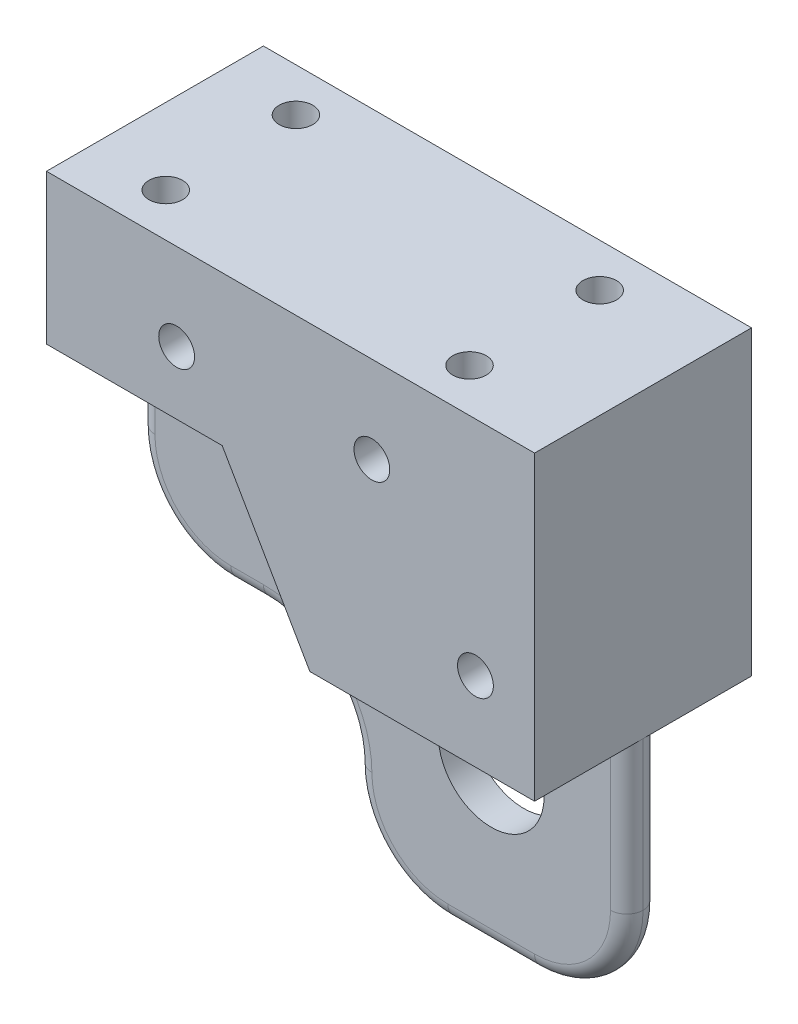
ISO-10303-21;
HEADER;
FILE_DESCRIPTION(('STEP AP214'),'2;1');
FILE_NAME('part.step','',(''),(''),'','','');
FILE_SCHEMA(('AUTOMOTIVE_DESIGN { 1 0 10303 214 1 1 1 1 }'));
ENDSEC;
DATA;
#1=APPLICATION_CONTEXT('core data for automotive mechanical design processes');
#2=APPLICATION_PROTOCOL_DEFINITION('international standard','automotive_design',2000,#1);
#3=PRODUCT_CONTEXT('',#1,'mechanical');
#4=PRODUCT('Part','Part','',(#3));
#5=PRODUCT_RELATED_PRODUCT_CATEGORY('part','',(#4));
#6=PRODUCT_DEFINITION_FORMATION('','',#4);
#7=PRODUCT_DEFINITION_CONTEXT('part definition',#1,'design');
#8=PRODUCT_DEFINITION('design','',#6,#7);
#9=PRODUCT_DEFINITION_SHAPE('','',#8);
#10=(LENGTH_UNIT() NAMED_UNIT(*) SI_UNIT(.MILLI.,.METRE.));
#11=(NAMED_UNIT(*) PLANE_ANGLE_UNIT() SI_UNIT($,.RADIAN.));
#12=(NAMED_UNIT(*) SI_UNIT($,.STERADIAN.) SOLID_ANGLE_UNIT());
#13=UNCERTAINTY_MEASURE_WITH_UNIT(LENGTH_MEASURE(1.E-05),#10,'distance_accuracy_value','');
#14=(GEOMETRIC_REPRESENTATION_CONTEXT(3) GLOBAL_UNCERTAINTY_ASSIGNED_CONTEXT((#13)) GLOBAL_UNIT_ASSIGNED_CONTEXT((#10,
#11,#12)) REPRESENTATION_CONTEXT('',''));
#15=CARTESIAN_POINT('',(0.,0.,0.));
#16=DIRECTION('',(0.,0.,1.));
#17=DIRECTION('',(1.,0.,0.));
#18=AXIS2_PLACEMENT_3D('',#15,#16,#17);
#19=CARTESIAN_POINT('',(35.,-17.5,-4.5));
#20=DIRECTION('',(0.,1.,0.));
#21=DIRECTION('',(0.,0.,1.));
#22=AXIS2_PLACEMENT_3D('',#19,#20,#21);
#23=CYLINDRICAL_SURFACE('',#22,1.55);
#24=CARTESIAN_POINT('',(35.,32.5,-4.5));
#25=DIRECTION('',(0.,1.,0.));
#26=DIRECTION('',(0.,0.,1.));
#27=AXIS2_PLACEMENT_3D('',#24,#25,#26);
#28=CIRCLE('',#27,1.55);
#29=CARTESIAN_POINT('',(35.,32.5,-2.95));
#30=VERTEX_POINT('',#29);
#31=EDGE_CURVE('E295',#30,#30,#28,.T.);
#32=ORIENTED_EDGE('',*,*,#31,.T.);
#33=EDGE_LOOP('',(#32));
#34=FACE_BOUND('',#33,.T.);
#35=CARTESIAN_POINT('',(35.,26.1,-4.5));
#36=DIRECTION('',(0.,-1.,0.));
#37=DIRECTION('',(1.,0.,0.));
#38=AXIS2_PLACEMENT_3D('',#35,#36,#37);
#39=CIRCLE('',#38,1.55);
#40=CARTESIAN_POINT('',(36.55,26.1,-4.5));
#41=VERTEX_POINT('',#40);
#42=EDGE_CURVE('E39',#41,#41,#39,.F.);
#43=ORIENTED_EDGE('',*,*,#42,.F.);
#44=EDGE_LOOP('',(#43));
#45=FACE_BOUND('',#44,.T.);
#46=ADVANCED_FACE('F35',(#34,#45),#23,.F.);
#47=CARTESIAN_POINT('',(35.,-17.5,7.5));
#48=DIRECTION('',(0.,1.,0.));
#49=DIRECTION('',(0.,0.,1.));
#50=AXIS2_PLACEMENT_3D('',#47,#48,#49);
#51=CYLINDRICAL_SURFACE('',#50,1.55);
#52=CARTESIAN_POINT('',(35.,32.5,7.5));
#53=DIRECTION('',(0.,1.,0.));
#54=DIRECTION('',(0.,0.,1.));
#55=AXIS2_PLACEMENT_3D('',#52,#53,#54);
#56=CIRCLE('',#55,1.55);
#57=CARTESIAN_POINT('',(35.,32.5,9.05));
#58=VERTEX_POINT('',#57);
#59=EDGE_CURVE('E336',#58,#58,#56,.T.);
#60=ORIENTED_EDGE('',*,*,#59,.T.);
#61=EDGE_LOOP('',(#60));
#62=FACE_BOUND('',#61,.T.);
#63=CARTESIAN_POINT('',(35.,26.1,7.5));
#64=DIRECTION('',(0.,-1.,0.));
#65=DIRECTION('',(1.,0.,0.));
#66=AXIS2_PLACEMENT_3D('',#63,#64,#65);
#67=CIRCLE('',#66,1.55);
#68=CARTESIAN_POINT('',(36.55,26.1,7.5));
#69=VERTEX_POINT('',#68);
#70=EDGE_CURVE('E301',#69,#69,#67,.F.);
#71=ORIENTED_EDGE('',*,*,#70,.F.);
#72=EDGE_LOOP('',(#71));
#73=FACE_BOUND('',#72,.T.);
#74=ADVANCED_FACE('F588',(#62,#73),#51,.F.);
#75=CARTESIAN_POINT('',(7.,-17.5,7.5));
#76=DIRECTION('',(0.,1.,0.));
#77=DIRECTION('',(0.,0.,1.));
#78=AXIS2_PLACEMENT_3D('',#75,#76,#77);
#79=CYLINDRICAL_SURFACE('',#78,1.55);
#80=CARTESIAN_POINT('',(7.,32.5,7.5));
#81=DIRECTION('',(0.,1.,0.));
#82=DIRECTION('',(0.,0.,-1.));
#83=AXIS2_PLACEMENT_3D('',#80,#81,#82);
#84=CIRCLE('',#83,1.55);
#85=CARTESIAN_POINT('',(7.,32.5,5.95));
#86=VERTEX_POINT('',#85);
#87=EDGE_CURVE('E332',#86,#86,#84,.T.);
#88=ORIENTED_EDGE('',*,*,#87,.T.);
#89=EDGE_LOOP('',(#88));
#90=FACE_BOUND('',#89,.T.);
#91=CARTESIAN_POINT('',(7.,26.1,7.5));
#92=DIRECTION('',(0.,-1.,0.));
#93=DIRECTION('',(0.,0.,-1.));
#94=AXIS2_PLACEMENT_3D('',#91,#92,#93);
#95=CIRCLE('',#94,1.55);
#96=CARTESIAN_POINT('',(7.,26.1,5.95));
#97=VERTEX_POINT('',#96);
#98=EDGE_CURVE('E248',#97,#97,#95,.F.);
#99=ORIENTED_EDGE('',*,*,#98,.F.);
#100=EDGE_LOOP('',(#99));
#101=FACE_BOUND('',#100,.T.);
#102=ADVANCED_FACE('F594',(#90,#101),#79,.F.);
#103=CARTESIAN_POINT('',(7.,-17.5,-4.5));
#104=DIRECTION('',(0.,1.,0.));
#105=DIRECTION('',(0.,0.,1.));
#106=AXIS2_PLACEMENT_3D('',#103,#104,#105);
#107=CYLINDRICAL_SURFACE('',#106,1.55);
#108=CARTESIAN_POINT('',(7.,32.5,-4.5));
#109=DIRECTION('',(0.,1.,0.));
#110=DIRECTION('',(0.,0.,1.));
#111=AXIS2_PLACEMENT_3D('',#108,#109,#110);
#112=CIRCLE('',#111,1.55);
#113=CARTESIAN_POINT('',(7.,32.5,-2.95));
#114=VERTEX_POINT('',#113);
#115=EDGE_CURVE('E335',#114,#114,#112,.T.);
#116=ORIENTED_EDGE('',*,*,#115,.T.);
#117=EDGE_LOOP('',(#116));
#118=FACE_BOUND('',#117,.T.);
#119=CARTESIAN_POINT('',(7.,26.1,-4.5));
#120=DIRECTION('',(0.,-1.,0.));
#121=DIRECTION('',(0.,0.,-1.));
#122=AXIS2_PLACEMENT_3D('',#119,#120,#121);
#123=CIRCLE('',#122,1.55);
#124=CARTESIAN_POINT('',(7.,26.1,-6.05));
#125=VERTEX_POINT('',#124);
#126=EDGE_CURVE('E296',#125,#125,#123,.F.);
#127=ORIENTED_EDGE('',*,*,#126,.F.);
#128=EDGE_LOOP('',(#127));
#129=FACE_BOUND('',#128,.T.);
#130=ADVANCED_FACE('F600',(#118,#129),#107,.F.);
#131=CARTESIAN_POINT('',(0.,0.,3.));
#132=DIRECTION('',(0.,0.,-1.));
#133=DIRECTION('',(-1.,0.,0.));
#134=AXIS2_PLACEMENT_3D('',#131,#132,#133);
#135=PLANE('',#134);
#136=CARTESIAN_POINT('',(36.5,-9.00000000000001,3.));
#137=DIRECTION('',(0.,0.,-1.));
#138=DIRECTION('',(-1.,0.,0.));
#139=AXIS2_PLACEMENT_3D('',#136,#137,#138);
#140=CIRCLE('',#139,7.);
#141=CARTESIAN_POINT('',(36.5,-16.,3.));
#142=VERTEX_POINT('',#141);
#143=CARTESIAN_POINT('',(43.5,-9.00000000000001,3.));
#144=VERTEX_POINT('',#143);
#145=EDGE_CURVE('E211',#142,#144,#140,.F.);
#146=ORIENTED_EDGE('',*,*,#145,.T.);
#147=DIRECTION('',(0.,1.,0.));
#148=VECTOR('',#147,1.);
#149=CARTESIAN_POINT('',(43.5,0.,3.));
#150=LINE('',#149,#148);
#151=CARTESIAN_POINT('',(43.5,4.69999999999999,3.));
#152=VERTEX_POINT('',#151);
#153=EDGE_CURVE('E232',#144,#152,#150,.T.);
#154=ORIENTED_EDGE('',*,*,#153,.T.);
#155=DIRECTION('',(-1.,0.,0.));
#156=VECTOR('',#155,1.);
#157=CARTESIAN_POINT('',(0.,4.69999999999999,3.));
#158=LINE('',#157,#156);
#159=CARTESIAN_POINT('',(24.2829037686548,4.69999999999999,3.));
#160=VERTEX_POINT('',#159);
#161=EDGE_CURVE('E388',#152,#160,#158,.T.);
#162=ORIENTED_EDGE('',*,*,#161,.T.);
#163=DIRECTION('',(-0.500000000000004,0.866025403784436,0.));
#164=VECTOR('',#163,1.);
#165=CARTESIAN_POINT('',(20.2473375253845,11.6898057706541,3.));
#166=LINE('',#165,#164);
#167=CARTESIAN_POINT('',(16.2,18.7,3.));
#168=VERTEX_POINT('',#167);
#169=EDGE_CURVE('E384',#160,#168,#166,.T.);
#170=ORIENTED_EDGE('',*,*,#169,.T.);
#171=DIRECTION('',(-1.,0.,0.));
#172=VECTOR('',#171,1.);
#173=CARTESIAN_POINT('',(0.,18.7,3.));
#174=LINE('',#173,#172);
#175=CARTESIAN_POINT('',(1.5,18.7,3.));
#176=VERTEX_POINT('',#175);
#177=EDGE_CURVE('E413',#168,#176,#174,.T.);
#178=ORIENTED_EDGE('',*,*,#177,.T.);
#179=DIRECTION('',(0.,-1.,0.));
#180=VECTOR('',#179,1.);
#181=CARTESIAN_POINT('',(1.5,0.,3.));
#182=LINE('',#181,#180);
#183=CARTESIAN_POINT('',(1.5,7.99999999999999,3.));
#184=VERTEX_POINT('',#183);
#185=EDGE_CURVE('E468',#176,#184,#182,.T.);
#186=ORIENTED_EDGE('',*,*,#185,.T.);
#187=CARTESIAN_POINT('',(8.5,7.99999999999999,3.));
#188=DIRECTION('',(0.,0.,-1.));
#189=DIRECTION('',(-1.,0.,0.));
#190=AXIS2_PLACEMENT_3D('',#187,#188,#189);
#191=CIRCLE('',#190,7.);
#192=CARTESIAN_POINT('',(8.5,0.999999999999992,3.));
#193=VERTEX_POINT('',#192);
#194=EDGE_CURVE('E470',#184,#193,#191,.F.);
#195=ORIENTED_EDGE('',*,*,#194,.T.);
#196=DIRECTION('',(-1.,0.,0.));
#197=VECTOR('',#196,1.);
#198=CARTESIAN_POINT('',(0.,0.999999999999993,3.));
#199=LINE('',#198,#197);
#200=CARTESIAN_POINT('',(11.5,0.999999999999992,3.));
#201=VERTEX_POINT('',#200);
#202=EDGE_CURVE('E472',#193,#201,#199,.F.);
#203=ORIENTED_EDGE('',*,*,#202,.T.);
#204=CARTESIAN_POINT('',(11.5,-9.00000000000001,3.));
#205=DIRECTION('',(0.,0.,-1.));
#206=DIRECTION('',(-1.,0.,0.));
#207=AXIS2_PLACEMENT_3D('',#204,#205,#206);
#208=CIRCLE('',#207,10.);
#209=CARTESIAN_POINT('',(21.5,-9.00000000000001,3.));
#210=VERTEX_POINT('',#209);
#211=EDGE_CURVE('E474',#201,#210,#208,.T.);
#212=ORIENTED_EDGE('',*,*,#211,.T.);
#213=CARTESIAN_POINT('',(28.5,-9.00000000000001,3.));
#214=DIRECTION('',(0.,0.,-1.));
#215=DIRECTION('',(-1.,0.,0.));
#216=AXIS2_PLACEMENT_3D('',#213,#214,#215);
#217=CIRCLE('',#216,7.);
#218=CARTESIAN_POINT('',(28.5,-16.,3.));
#219=VERTEX_POINT('',#218);
#220=EDGE_CURVE('E214',#210,#219,#217,.F.);
#221=ORIENTED_EDGE('',*,*,#220,.T.);
#222=DIRECTION('',(1.,0.,0.));
#223=VECTOR('',#222,1.);
#224=CARTESIAN_POINT('',(0.,-16.,3.));
#225=LINE('',#224,#223);
#226=EDGE_CURVE('E206',#219,#142,#225,.T.);
#227=ORIENTED_EDGE('',*,*,#226,.T.);
#228=EDGE_LOOP('',(#146,#154,#162,#170,#178,#186,#195,#203,#212,#221,#227));
#229=FACE_BOUND('',#228,.T.);
#230=CARTESIAN_POINT('',(32.5,-3.00000000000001,3.));
#231=DIRECTION('',(0.,0.,1.));
#232=DIRECTION('',(1.,0.,0.));
#233=AXIS2_PLACEMENT_3D('',#230,#231,#232);
#234=CIRCLE('',#233,4.875);
#235=CARTESIAN_POINT('',(37.375,-3.00000000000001,3.));
#236=VERTEX_POINT('',#235);
#237=EDGE_CURVE('E423',#236,#236,#234,.T.);
#238=ORIENTED_EDGE('',*,*,#237,.F.);
#239=EDGE_LOOP('',(#238));
#240=FACE_BOUND('',#239,.T.);
#241=CARTESIAN_POINT('',(12.5,12.,3.));
#242=DIRECTION('',(0.,0.,1.));
#243=DIRECTION('',(1.,0.,0.));
#244=AXIS2_PLACEMENT_3D('',#241,#242,#243);
#245=CIRCLE('',#244,4.875);
#246=CARTESIAN_POINT('',(17.375,12.,3.));
#247=VERTEX_POINT('',#246);
#248=EDGE_CURVE('E417',#247,#247,#245,.T.);
#249=ORIENTED_EDGE('',*,*,#248,.F.);
#250=EDGE_LOOP('',(#249));
#251=FACE_BOUND('',#250,.T.);
#252=ADVANCED_FACE('F208',(#229,#240,#251),#135,.F.);
#253=CARTESIAN_POINT('',(0.,0.,0.));
#254=DIRECTION('',(0.,0.,-1.));
#255=DIRECTION('',(-1.,0.,0.));
#256=AXIS2_PLACEMENT_3D('',#253,#254,#255);
#257=PLANE('',#256);
#258=DIRECTION('',(-1.,0.,0.));
#259=VECTOR('',#258,1.);
#260=CARTESIAN_POINT('',(0.,4.69999999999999,0.));
#261=LINE('',#260,#259);
#262=CARTESIAN_POINT('',(43.5,4.69999999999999,0.));
#263=VERTEX_POINT('',#262);
#264=CARTESIAN_POINT('',(25.4376043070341,4.69999999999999,0.));
#265=VERTEX_POINT('',#264);
#266=EDGE_CURVE('E386',#263,#265,#261,.T.);
#267=ORIENTED_EDGE('',*,*,#266,.F.);
#268=DIRECTION('',(0.,1.,0.));
#269=VECTOR('',#268,1.);
#270=CARTESIAN_POINT('',(43.5,-9.00000000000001,0.));
#271=LINE('',#270,#269);
#272=CARTESIAN_POINT('',(43.5,-9.00000000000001,0.));
#273=VERTEX_POINT('',#272);
#274=EDGE_CURVE('E465',#263,#273,#271,.F.);
#275=ORIENTED_EDGE('',*,*,#274,.T.);
#276=CARTESIAN_POINT('',(36.5,-9.00000000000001,0.));
#277=DIRECTION('',(0.,0.,-1.));
#278=DIRECTION('',(-1.,0.,0.));
#279=AXIS2_PLACEMENT_3D('',#276,#277,#278);
#280=CIRCLE('',#279,7.);
#281=CARTESIAN_POINT('',(36.5,-16.,0.));
#282=VERTEX_POINT('',#281);
#283=EDGE_CURVE('E463',#273,#282,#280,.T.);
#284=ORIENTED_EDGE('',*,*,#283,.T.);
#285=DIRECTION('',(1.,0.,0.));
#286=VECTOR('',#285,1.);
#287=CARTESIAN_POINT('',(28.5,-16.,0.));
#288=LINE('',#287,#286);
#289=CARTESIAN_POINT('',(28.5,-16.,0.));
#290=VERTEX_POINT('',#289);
#291=EDGE_CURVE('E461',#282,#290,#288,.F.);
#292=ORIENTED_EDGE('',*,*,#291,.T.);
#293=CARTESIAN_POINT('',(28.5,-9.00000000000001,0.));
#294=DIRECTION('',(0.,0.,-1.));
#295=DIRECTION('',(-1.,0.,0.));
#296=AXIS2_PLACEMENT_3D('',#293,#294,#295);
#297=CIRCLE('',#296,7.);
#298=CARTESIAN_POINT('',(21.5,-9.00000000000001,0.));
#299=VERTEX_POINT('',#298);
#300=EDGE_CURVE('E459',#290,#299,#297,.T.);
#301=ORIENTED_EDGE('',*,*,#300,.T.);
#302=CARTESIAN_POINT('',(11.5,-9.00000000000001,0.));
#303=DIRECTION('',(0.,0.,-1.));
#304=DIRECTION('',(-1.,0.,0.));
#305=AXIS2_PLACEMENT_3D('',#302,#303,#304);
#306=CIRCLE('',#305,10.);
#307=CARTESIAN_POINT('',(11.5,0.999999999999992,0.));
#308=VERTEX_POINT('',#307);
#309=EDGE_CURVE('E457',#299,#308,#306,.F.);
#310=ORIENTED_EDGE('',*,*,#309,.T.);
#311=DIRECTION('',(-1.,0.,0.));
#312=VECTOR('',#311,1.);
#313=CARTESIAN_POINT('',(8.5,0.999999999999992,0.));
#314=LINE('',#313,#312);
#315=CARTESIAN_POINT('',(8.5,0.999999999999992,0.));
#316=VERTEX_POINT('',#315);
#317=EDGE_CURVE('E455',#308,#316,#314,.T.);
#318=ORIENTED_EDGE('',*,*,#317,.T.);
#319=CARTESIAN_POINT('',(8.5,7.99999999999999,0.));
#320=DIRECTION('',(0.,0.,-1.));
#321=DIRECTION('',(-1.,0.,0.));
#322=AXIS2_PLACEMENT_3D('',#319,#320,#321);
#323=CIRCLE('',#322,7.);
#324=CARTESIAN_POINT('',(1.5,7.99999999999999,0.));
#325=VERTEX_POINT('',#324);
#326=EDGE_CURVE('E453',#316,#325,#323,.T.);
#327=ORIENTED_EDGE('',*,*,#326,.T.);
#328=DIRECTION('',(0.,-1.,0.));
#329=VECTOR('',#328,1.);
#330=CARTESIAN_POINT('',(1.5,18.7,0.));
#331=LINE('',#330,#329);
#332=CARTESIAN_POINT('',(1.5,18.7,0.));
#333=VERTEX_POINT('',#332);
#334=EDGE_CURVE('E451',#325,#333,#331,.F.);
#335=ORIENTED_EDGE('',*,*,#334,.T.);
#336=DIRECTION('',(-1.,0.,0.));
#337=VECTOR('',#336,1.);
#338=CARTESIAN_POINT('',(0.,18.7,0.));
#339=LINE('',#338,#337);
#340=CARTESIAN_POINT('',(15.0452994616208,18.7,0.));
#341=VERTEX_POINT('',#340);
#342=EDGE_CURVE('E410',#341,#333,#339,.T.);
#343=ORIENTED_EDGE('',*,*,#342,.F.);
#344=CARTESIAN_POINT('',(15.0452994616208,16.7,0.));
#345=DIRECTION('',(0.,0.,-1.));
#346=DIRECTION('',(-1.,0.,0.));
#347=AXIS2_PLACEMENT_3D('',#344,#345,#346);
#348=CIRCLE('',#347,2.);
#349=CARTESIAN_POINT('',(16.7773502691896,17.7,0.));
#350=VERTEX_POINT('',#349);
#351=EDGE_CURVE('E444',#341,#350,#348,.T.);
#352=ORIENTED_EDGE('',*,*,#351,.T.);
#353=DIRECTION('',(-0.500000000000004,0.866025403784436,0.));
#354=VECTOR('',#353,1.);
#355=CARTESIAN_POINT('',(20.2473375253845,11.6898057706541,0.));
#356=LINE('',#355,#354);
#357=CARTESIAN_POINT('',(23.7055534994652,5.69999999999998,0.));
#358=VERTEX_POINT('',#357);
#359=EDGE_CURVE('E375',#358,#350,#356,.T.);
#360=ORIENTED_EDGE('',*,*,#359,.F.);
#361=CARTESIAN_POINT('',(25.4376043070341,6.69999999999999,0.));
#362=DIRECTION('',(0.,0.,-1.));
#363=DIRECTION('',(-1.,0.,0.));
#364=AXIS2_PLACEMENT_3D('',#361,#362,#363);
#365=CIRCLE('',#364,2.);
#366=EDGE_CURVE('E446',#358,#265,#365,.F.);
#367=ORIENTED_EDGE('',*,*,#366,.T.);
#368=EDGE_LOOP('',(#267,#275,#284,#292,#301,#310,#318,#327,#335,#343,#352,#360,#367));
#369=FACE_BOUND('',#368,.T.);
#370=CARTESIAN_POINT('',(32.5,-3.00000000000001,0.));
#371=DIRECTION('',(0.,0.,1.));
#372=DIRECTION('',(1.,0.,0.));
#373=AXIS2_PLACEMENT_3D('',#370,#371,#372);
#374=CIRCLE('',#373,4.875);
#375=CARTESIAN_POINT('',(37.375,-3.00000000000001,0.));
#376=VERTEX_POINT('',#375);
#377=EDGE_CURVE('E420',#376,#376,#374,.T.);
#378=ORIENTED_EDGE('',*,*,#377,.T.);
#379=EDGE_LOOP('',(#378));
#380=FACE_BOUND('',#379,.T.);
#381=CARTESIAN_POINT('',(12.5,12.,0.));
#382=DIRECTION('',(0.,0.,1.));
#383=DIRECTION('',(1.,0.,0.));
#384=AXIS2_PLACEMENT_3D('',#381,#382,#383);
#385=CIRCLE('',#384,4.875);
#386=CARTESIAN_POINT('',(17.375,12.,0.));
#387=VERTEX_POINT('',#386);
#388=EDGE_CURVE('E416',#387,#387,#385,.T.);
#389=ORIENTED_EDGE('',*,*,#388,.T.);
#390=EDGE_LOOP('',(#389));
#391=FACE_BOUND('',#390,.T.);
#392=ADVANCED_FACE('F533',(#369,#380,#391),#257,.T.);
#393=CARTESIAN_POINT('',(45.,32.5,3.));
#394=DIRECTION('',(-1.,0.,0.));
#395=DIRECTION('',(0.,0.,1.));
#396=AXIS2_PLACEMENT_3D('',#393,#394,#395);
#397=PLANE('',#396);
#398=DIRECTION('',(0.,0.,-1.));
#399=VECTOR('',#398,1.);
#400=CARTESIAN_POINT('',(45.,4.69999999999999,11.5));
#401=LINE('',#400,#399);
#402=CARTESIAN_POINT('',(45.,4.69999999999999,11.5));
#403=VERTEX_POINT('',#402);
#404=CARTESIAN_POINT('',(45.,4.69999999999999,1.5));
#405=VERTEX_POINT('',#404);
#406=EDGE_CURVE('E373',#403,#405,#401,.T.);
#407=ORIENTED_EDGE('',*,*,#406,.T.);
#408=CARTESIAN_POINT('',(45.,4.69999999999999,-8.5));
#409=VERTEX_POINT('',#408);
#410=EDGE_CURVE('E376',#405,#409,#401,.T.);
#411=ORIENTED_EDGE('',*,*,#410,.T.);
#412=DIRECTION('',(0.,-1.,0.));
#413=VECTOR('',#412,1.);
#414=CARTESIAN_POINT('',(45.,32.5,-8.5));
#415=LINE('',#414,#413);
#416=CARTESIAN_POINT('',(45.,32.5,-8.5));
#417=VERTEX_POINT('',#416);
#418=EDGE_CURVE('E96',#417,#409,#415,.T.);
#419=ORIENTED_EDGE('',*,*,#418,.F.);
#420=DIRECTION('',(0.,0.,-1.));
#421=VECTOR('',#420,1.);
#422=CARTESIAN_POINT('',(45.,32.5,3.));
#423=LINE('',#422,#421);
#424=CARTESIAN_POINT('',(45.,32.5,11.5));
#425=VERTEX_POINT('',#424);
#426=EDGE_CURVE('E430',#425,#417,#423,.T.);
#427=ORIENTED_EDGE('',*,*,#426,.F.);
#428=DIRECTION('',(0.,-1.,0.));
#429=VECTOR('',#428,1.);
#430=CARTESIAN_POINT('',(45.,32.5,11.5));
#431=LINE('',#430,#429);
#432=EDGE_CURVE('E398',#425,#403,#431,.T.);
#433=ORIENTED_EDGE('',*,*,#432,.T.);
#434=EDGE_LOOP('',(#407,#411,#419,#427,#433));
#435=FACE_BOUND('',#434,.T.);
#436=ADVANCED_FACE('F544',(#435),#397,.F.);
#437=CARTESIAN_POINT('',(0.,32.5,3.));
#438=DIRECTION('',(0.,-1.,0.));
#439=DIRECTION('',(0.,0.,-1.));
#440=AXIS2_PLACEMENT_3D('',#437,#438,#439);
#441=PLANE('',#440);
#442=ORIENTED_EDGE('',*,*,#31,.F.);
#443=EDGE_LOOP('',(#442));
#444=FACE_BOUND('',#443,.T.);
#445=ORIENTED_EDGE('',*,*,#59,.F.);
#446=EDGE_LOOP('',(#445));
#447=FACE_BOUND('',#446,.T.);
#448=ORIENTED_EDGE('',*,*,#87,.F.);
#449=EDGE_LOOP('',(#448));
#450=FACE_BOUND('',#449,.T.);
#451=ORIENTED_EDGE('',*,*,#115,.F.);
#452=EDGE_LOOP('',(#451));
#453=FACE_BOUND('',#452,.T.);
#454=ORIENTED_EDGE('',*,*,#426,.T.);
#455=DIRECTION('',(1.,0.,0.));
#456=VECTOR('',#455,1.);
#457=CARTESIAN_POINT('',(45.,32.5,-8.5));
#458=LINE('',#457,#456);
#459=CARTESIAN_POINT('',(0.,32.5,-8.5));
#460=VERTEX_POINT('',#459);
#461=EDGE_CURVE('E396',#460,#417,#458,.T.);
#462=ORIENTED_EDGE('',*,*,#461,.F.);
#463=DIRECTION('',(0.,0.,-1.));
#464=VECTOR('',#463,1.);
#465=CARTESIAN_POINT('',(0.,32.5,3.));
#466=LINE('',#465,#464);
#467=CARTESIAN_POINT('',(0.,32.5,11.5));
#468=VERTEX_POINT('',#467);
#469=EDGE_CURVE('E426',#468,#460,#466,.T.);
#470=ORIENTED_EDGE('',*,*,#469,.F.);
#471=DIRECTION('',(1.,0.,0.));
#472=VECTOR('',#471,1.);
#473=CARTESIAN_POINT('',(45.,32.5,11.5));
#474=LINE('',#473,#472);
#475=EDGE_CURVE('E405',#468,#425,#474,.T.);
#476=ORIENTED_EDGE('',*,*,#475,.T.);
#477=EDGE_LOOP('',(#454,#462,#470,#476));
#478=FACE_BOUND('',#477,.T.);
#479=ADVANCED_FACE('F546',(#444,#447,#450,#453,#478),#441,.F.);
#480=CARTESIAN_POINT('',(0.,32.5,3.));
#481=DIRECTION('',(1.,0.,0.));
#482=DIRECTION('',(0.,1.,0.));
#483=AXIS2_PLACEMENT_3D('',#480,#481,#482);
#484=PLANE('',#483);
#485=DIRECTION('',(0.,0.,-1.));
#486=VECTOR('',#485,1.);
#487=CARTESIAN_POINT('',(0.,18.7,11.5));
#488=LINE('',#487,#486);
#489=CARTESIAN_POINT('',(0.,18.7,1.5));
#490=VERTEX_POINT('',#489);
#491=CARTESIAN_POINT('',(0.,18.7,-8.5));
#492=VERTEX_POINT('',#491);
#493=EDGE_CURVE('E408',#490,#492,#488,.T.);
#494=ORIENTED_EDGE('',*,*,#493,.F.);
#495=CARTESIAN_POINT('',(0.,18.7,11.5));
#496=VERTEX_POINT('',#495);
#497=EDGE_CURVE('E53',#496,#490,#488,.T.);
#498=ORIENTED_EDGE('',*,*,#497,.F.);
#499=DIRECTION('',(0.,1.,0.));
#500=VECTOR('',#499,1.);
#501=CARTESIAN_POINT('',(0.,32.5,11.5));
#502=LINE('',#501,#500);
#503=EDGE_CURVE('E402',#496,#468,#502,.T.);
#504=ORIENTED_EDGE('',*,*,#503,.T.);
#505=ORIENTED_EDGE('',*,*,#469,.T.);
#506=DIRECTION('',(0.,1.,0.));
#507=VECTOR('',#506,1.);
#508=CARTESIAN_POINT('',(0.,32.5,-8.5));
#509=LINE('',#508,#507);
#510=EDGE_CURVE('E393',#492,#460,#509,.T.);
#511=ORIENTED_EDGE('',*,*,#510,.F.);
#512=EDGE_LOOP('',(#494,#498,#504,#505,#511));
#513=FACE_BOUND('',#512,.T.);
#514=ADVANCED_FACE('F550',(#513),#484,.F.);
#515=CARTESIAN_POINT('',(32.5,-3.00000000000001,3.));
#516=DIRECTION('',(0.,0.,-1.));
#517=DIRECTION('',(-1.,0.,0.));
#518=AXIS2_PLACEMENT_3D('',#515,#516,#517);
#519=CYLINDRICAL_SURFACE('',#518,4.875);
#520=ORIENTED_EDGE('',*,*,#237,.T.);
#521=EDGE_LOOP('',(#520));
#522=FACE_BOUND('',#521,.T.);
#523=ORIENTED_EDGE('',*,*,#377,.F.);
#524=EDGE_LOOP('',(#523));
#525=FACE_BOUND('',#524,.T.);
#526=ADVANCED_FACE('F630',(#522,#525),#519,.F.);
#527=CARTESIAN_POINT('',(12.5,12.,3.));
#528=DIRECTION('',(0.,0.,-1.));
#529=DIRECTION('',(-1.,0.,0.));
#530=AXIS2_PLACEMENT_3D('',#527,#528,#529);
#531=CYLINDRICAL_SURFACE('',#530,4.875);
#532=ORIENTED_EDGE('',*,*,#248,.T.);
#533=EDGE_LOOP('',(#532));
#534=FACE_BOUND('',#533,.T.);
#535=ORIENTED_EDGE('',*,*,#388,.F.);
#536=EDGE_LOOP('',(#535));
#537=FACE_BOUND('',#536,.T.);
#538=ADVANCED_FACE('F620',(#534,#537),#531,.F.);
#539=CARTESIAN_POINT('',(0.,0.,-8.5));
#540=DIRECTION('',(0.,0.,-1.));
#541=DIRECTION('',(-1.,0.,0.));
#542=AXIS2_PLACEMENT_3D('',#539,#540,#541);
#543=PLANE('',#542);
#544=CARTESIAN_POINT('',(12.,24.5,-8.5));
#545=DIRECTION('',(0.,0.,-1.));
#546=DIRECTION('',(-1.,0.,0.));
#547=AXIS2_PLACEMENT_3D('',#544,#545,#546);
#548=CIRCLE('',#547,1.65);
#549=CARTESIAN_POINT('',(10.35,24.5,-8.5));
#550=VERTEX_POINT('',#549);
#551=EDGE_CURVE('E348',#550,#550,#548,.T.);
#552=ORIENTED_EDGE('',*,*,#551,.F.);
#553=EDGE_LOOP('',(#552));
#554=FACE_BOUND('',#553,.T.);
#555=CARTESIAN_POINT('',(30.,24.5,-8.5));
#556=DIRECTION('',(0.,0.,-1.));
#557=DIRECTION('',(-1.,0.,0.));
#558=AXIS2_PLACEMENT_3D('',#555,#556,#557);
#559=CIRCLE('',#558,1.65);
#560=CARTESIAN_POINT('',(28.35,24.5,-8.5));
#561=VERTEX_POINT('',#560);
#562=EDGE_CURVE('E354',#561,#561,#559,.T.);
#563=ORIENTED_EDGE('',*,*,#562,.F.);
#564=EDGE_LOOP('',(#563));
#565=FACE_BOUND('',#564,.T.);
#566=CARTESIAN_POINT('',(39.55,12.,-8.5));
#567=DIRECTION('',(0.,0.,-1.));
#568=DIRECTION('',(-1.,0.,0.));
#569=AXIS2_PLACEMENT_3D('',#566,#567,#568);
#570=CIRCLE('',#569,1.65);
#571=CARTESIAN_POINT('',(37.9,12.,-8.5));
#572=VERTEX_POINT('',#571);
#573=EDGE_CURVE('E343',#572,#572,#570,.T.);
#574=ORIENTED_EDGE('',*,*,#573,.F.);
#575=EDGE_LOOP('',(#574));
#576=FACE_BOUND('',#575,.T.);
#577=DIRECTION('',(-1.,0.,0.));
#578=VECTOR('',#577,1.);
#579=CARTESIAN_POINT('',(24.2829037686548,4.69999999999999,-8.5));
#580=LINE('',#579,#578);
#581=CARTESIAN_POINT('',(25.4376043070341,4.69999999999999,-8.5));
#582=VERTEX_POINT('',#581);
#583=EDGE_CURVE('E347',#409,#582,#580,.T.);
#584=ORIENTED_EDGE('',*,*,#583,.T.);
#585=CARTESIAN_POINT('',(25.4376043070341,6.69999999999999,-8.5));
#586=DIRECTION('',(0.,0.,-1.));
#587=DIRECTION('',(-1.,0.,0.));
#588=AXIS2_PLACEMENT_3D('',#585,#586,#587);
#589=CIRCLE('',#588,2.);
#590=CARTESIAN_POINT('',(23.7055534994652,5.69999999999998,-8.5));
#591=VERTEX_POINT('',#590);
#592=EDGE_CURVE('E435',#582,#591,#589,.T.);
#593=ORIENTED_EDGE('',*,*,#592,.T.);
#594=DIRECTION('',(-0.500000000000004,0.866025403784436,0.));
#595=VECTOR('',#594,1.);
#596=CARTESIAN_POINT('',(24.2829037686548,4.69999999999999,-8.5));
#597=LINE('',#596,#595);
#598=CARTESIAN_POINT('',(16.7773502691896,17.7,-8.5));
#599=VERTEX_POINT('',#598);
#600=EDGE_CURVE('E363',#591,#599,#597,.T.);
#601=ORIENTED_EDGE('',*,*,#600,.T.);
#602=CARTESIAN_POINT('',(15.0452994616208,16.7,-8.5));
#603=DIRECTION('',(0.,0.,-1.));
#604=DIRECTION('',(-1.,0.,0.));
#605=AXIS2_PLACEMENT_3D('',#602,#603,#604);
#606=CIRCLE('',#605,2.);
#607=CARTESIAN_POINT('',(15.0452994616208,18.7,-8.5));
#608=VERTEX_POINT('',#607);
#609=EDGE_CURVE('E449',#599,#608,#606,.F.);
#610=ORIENTED_EDGE('',*,*,#609,.T.);
#611=DIRECTION('',(-1.,0.,0.));
#612=VECTOR('',#611,1.);
#613=CARTESIAN_POINT('',(45.,18.7,-8.5));
#614=LINE('',#613,#612);
#615=EDGE_CURVE('E391',#608,#492,#614,.T.);
#616=ORIENTED_EDGE('',*,*,#615,.T.);
#617=ORIENTED_EDGE('',*,*,#510,.T.);
#618=ORIENTED_EDGE('',*,*,#461,.T.);
#619=ORIENTED_EDGE('',*,*,#418,.T.);
#620=EDGE_LOOP('',(#584,#593,#601,#610,#616,#617,#618,#619));
#621=FACE_BOUND('',#620,.T.);
#622=ADVANCED_FACE('F572',(#554,#565,#576,#621),#543,.T.);
#623=CARTESIAN_POINT('',(45.,18.7,11.5));
#624=DIRECTION('',(0.,-1.,0.));
#625=DIRECTION('',(0.,0.,-1.));
#626=AXIS2_PLACEMENT_3D('',#623,#624,#625);
#627=PLANE('',#626);
#628=CARTESIAN_POINT('',(7.,18.7,-4.5));
#629=DIRECTION('',(0.,-1.,0.));
#630=DIRECTION('',(0.,0.,-1.));
#631=AXIS2_PLACEMENT_3D('',#628,#629,#630);
#632=CIRCLE('',#631,2.6);
#633=CARTESIAN_POINT('',(7.,18.7,-7.1));
#634=VERTEX_POINT('',#633);
#635=EDGE_CURVE('E324',#634,#634,#632,.T.);
#636=ORIENTED_EDGE('',*,*,#635,.F.);
#637=EDGE_LOOP('',(#636));
#638=FACE_BOUND('',#637,.T.);
#639=ORIENTED_EDGE('',*,*,#615,.F.);
#640=DIRECTION('',(0.,0.,-1.));
#641=VECTOR('',#640,1.);
#642=CARTESIAN_POINT('',(15.0452994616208,18.7,0.));
#643=LINE('',#642,#641);
#644=EDGE_CURVE('E442',#608,#341,#643,.F.);
#645=ORIENTED_EDGE('',*,*,#644,.T.);
#646=ORIENTED_EDGE('',*,*,#342,.T.);
#647=CARTESIAN_POINT('',(1.5,18.7,1.5));
#648=DIRECTION('',(0.,-1.,0.));
#649=DIRECTION('',(0.,0.,-1.));
#650=AXIS2_PLACEMENT_3D('',#647,#648,#649);
#651=CIRCLE('',#650,1.5);
#652=EDGE_CURVE('E45',#333,#490,#651,.F.);
#653=ORIENTED_EDGE('',*,*,#652,.T.);
#654=ORIENTED_EDGE('',*,*,#493,.T.);
#655=EDGE_LOOP('',(#639,#645,#646,#653,#654));
#656=FACE_BOUND('',#655,.T.);
#657=ADVANCED_FACE('F555',(#638,#656),#627,.T.);
#658=CARTESIAN_POINT('',(7.,18.7,7.5));
#659=DIRECTION('',(0.,-1.,0.));
#660=DIRECTION('',(0.,0.,-1.));
#661=AXIS2_PLACEMENT_3D('',#658,#659,#660);
#662=CIRCLE('',#661,2.6);
#663=CARTESIAN_POINT('',(7.,18.7,4.9));
#664=VERTEX_POINT('',#663);
#665=EDGE_CURVE('E307',#664,#664,#662,.T.);
#666=ORIENTED_EDGE('',*,*,#665,.F.);
#667=EDGE_LOOP('',(#666));
#668=FACE_BOUND('',#667,.T.);
#669=DIRECTION('',(0.,0.,-1.));
#670=VECTOR('',#669,1.);
#671=CARTESIAN_POINT('',(16.2,18.7,11.5));
#672=LINE('',#671,#670);
#673=CARTESIAN_POINT('',(16.2,18.7,11.5));
#674=VERTEX_POINT('',#673);
#675=EDGE_CURVE('E377',#674,#168,#672,.T.);
#676=ORIENTED_EDGE('',*,*,#675,.F.);
#677=DIRECTION('',(-1.,0.,0.));
#678=VECTOR('',#677,1.);
#679=CARTESIAN_POINT('',(45.,18.7,11.5));
#680=LINE('',#679,#678);
#681=EDGE_CURVE('E400',#674,#496,#680,.T.);
#682=ORIENTED_EDGE('',*,*,#681,.T.);
#683=ORIENTED_EDGE('',*,*,#497,.T.);
#684=CARTESIAN_POINT('',(1.5,18.7,1.5));
#685=DIRECTION('',(0.,-1.,0.));
#686=DIRECTION('',(0.,0.,-1.));
#687=AXIS2_PLACEMENT_3D('',#684,#685,#686);
#688=CIRCLE('',#687,1.5);
#689=EDGE_CURVE('E11',#490,#176,#688,.F.);
#690=ORIENTED_EDGE('',*,*,#689,.T.);
#691=ORIENTED_EDGE('',*,*,#177,.F.);
#692=EDGE_LOOP('',(#676,#682,#683,#690,#691));
#693=FACE_BOUND('',#692,.T.);
#694=ADVANCED_FACE('F516',(#668,#693),#627,.T.);
#695=CARTESIAN_POINT('',(0.,0.,11.5));
#696=DIRECTION('',(0.,0.,-1.));
#697=DIRECTION('',(-1.,0.,0.));
#698=AXIS2_PLACEMENT_3D('',#695,#696,#697);
#699=PLANE('',#698);
#700=CARTESIAN_POINT('',(12.,24.5,11.5));
#701=DIRECTION('',(0.,0.,-1.));
#702=DIRECTION('',(-1.,0.,0.));
#703=AXIS2_PLACEMENT_3D('',#700,#701,#702);
#704=CIRCLE('',#703,1.65);
#705=CARTESIAN_POINT('',(10.35,24.5,11.5));
#706=VERTEX_POINT('',#705);
#707=EDGE_CURVE('E344',#706,#706,#704,.T.);
#708=ORIENTED_EDGE('',*,*,#707,.T.);
#709=EDGE_LOOP('',(#708));
#710=FACE_BOUND('',#709,.T.);
#711=CARTESIAN_POINT('',(30.,24.5,11.5));
#712=DIRECTION('',(0.,0.,-1.));
#713=DIRECTION('',(-1.,0.,0.));
#714=AXIS2_PLACEMENT_3D('',#711,#712,#713);
#715=CIRCLE('',#714,1.65);
#716=CARTESIAN_POINT('',(28.35,24.5,11.5));
#717=VERTEX_POINT('',#716);
#718=EDGE_CURVE('E351',#717,#717,#715,.T.);
#719=ORIENTED_EDGE('',*,*,#718,.T.);
#720=EDGE_LOOP('',(#719));
#721=FACE_BOUND('',#720,.T.);
#722=CARTESIAN_POINT('',(39.55,12.,11.5));
#723=DIRECTION('',(0.,0.,-1.));
#724=DIRECTION('',(-1.,0.,0.));
#725=AXIS2_PLACEMENT_3D('',#722,#723,#724);
#726=CIRCLE('',#725,1.65);
#727=CARTESIAN_POINT('',(37.9,12.,11.5));
#728=VERTEX_POINT('',#727);
#729=EDGE_CURVE('E357',#728,#728,#726,.T.);
#730=ORIENTED_EDGE('',*,*,#729,.T.);
#731=EDGE_LOOP('',(#730));
#732=FACE_BOUND('',#731,.T.);
#733=ORIENTED_EDGE('',*,*,#432,.F.);
#734=ORIENTED_EDGE('',*,*,#475,.F.);
#735=ORIENTED_EDGE('',*,*,#503,.F.);
#736=ORIENTED_EDGE('',*,*,#681,.F.);
#737=DIRECTION('',(-0.500000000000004,0.866025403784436,0.));
#738=VECTOR('',#737,1.);
#739=CARTESIAN_POINT('',(24.2829037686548,4.69999999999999,11.5));
#740=LINE('',#739,#738);
#741=CARTESIAN_POINT('',(24.2829037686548,4.69999999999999,11.5));
#742=VERTEX_POINT('',#741);
#743=EDGE_CURVE('E369',#742,#674,#740,.T.);
#744=ORIENTED_EDGE('',*,*,#743,.F.);
#745=DIRECTION('',(-1.,0.,0.));
#746=VECTOR('',#745,1.);
#747=CARTESIAN_POINT('',(24.2829037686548,4.69999999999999,11.5));
#748=LINE('',#747,#746);
#749=EDGE_CURVE('E366',#403,#742,#748,.T.);
#750=ORIENTED_EDGE('',*,*,#749,.F.);
#751=EDGE_LOOP('',(#733,#734,#735,#736,#744,#750));
#752=FACE_BOUND('',#751,.T.);
#753=ADVANCED_FACE('F511',(#710,#721,#732,#752),#699,.F.);
#754=CARTESIAN_POINT('',(24.2829037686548,4.69999999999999,11.5));
#755=DIRECTION('',(-0.866025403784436,-0.500000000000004,0.));
#756=DIRECTION('',(0.500000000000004,-0.866025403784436,0.));
#757=AXIS2_PLACEMENT_3D('',#754,#755,#756);
#758=PLANE('',#757);
#759=ORIENTED_EDGE('',*,*,#169,.F.);
#760=DIRECTION('',(0.,0.,-1.));
#761=VECTOR('',#760,1.);
#762=CARTESIAN_POINT('',(24.2829037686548,4.69999999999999,11.5));
#763=LINE('',#762,#761);
#764=EDGE_CURVE('E372',#742,#160,#763,.T.);
#765=ORIENTED_EDGE('',*,*,#764,.F.);
#766=ORIENTED_EDGE('',*,*,#743,.T.);
#767=ORIENTED_EDGE('',*,*,#675,.T.);
#768=EDGE_LOOP('',(#759,#765,#766,#767));
#769=FACE_BOUND('',#768,.T.);
#770=ADVANCED_FACE('F508',(#769),#758,.T.);
#771=CARTESIAN_POINT('',(24.2829037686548,4.69999999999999,11.5));
#772=DIRECTION('',(0.,-1.,0.));
#773=DIRECTION('',(1.,0.,0.));
#774=AXIS2_PLACEMENT_3D('',#771,#772,#773);
#775=PLANE('',#774);
#776=CARTESIAN_POINT('',(35.,4.69999999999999,7.5));
#777=DIRECTION('',(0.,-1.,0.));
#778=DIRECTION('',(1.,0.,0.));
#779=AXIS2_PLACEMENT_3D('',#776,#777,#778);
#780=CIRCLE('',#779,2.6);
#781=CARTESIAN_POINT('',(37.6,4.69999999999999,7.5));
#782=VERTEX_POINT('',#781);
#783=EDGE_CURVE('E319',#782,#782,#780,.T.);
#784=ORIENTED_EDGE('',*,*,#783,.F.);
#785=EDGE_LOOP('',(#784));
#786=FACE_BOUND('',#785,.T.);
#787=ORIENTED_EDGE('',*,*,#161,.F.);
#788=CARTESIAN_POINT('',(43.5,4.69999999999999,1.5));
#789=DIRECTION('',(0.,-1.,0.));
#790=DIRECTION('',(1.,0.,0.));
#791=AXIS2_PLACEMENT_3D('',#788,#789,#790);
#792=CIRCLE('',#791,1.5);
#793=EDGE_CURVE('E239',#152,#405,#792,.F.);
#794=ORIENTED_EDGE('',*,*,#793,.T.);
#795=ORIENTED_EDGE('',*,*,#406,.F.);
#796=ORIENTED_EDGE('',*,*,#749,.T.);
#797=ORIENTED_EDGE('',*,*,#764,.T.);
#798=EDGE_LOOP('',(#787,#794,#795,#796,#797));
#799=FACE_BOUND('',#798,.T.);
#800=ADVANCED_FACE('F503',(#786,#799),#775,.T.);
#801=CARTESIAN_POINT('',(35.,4.69999999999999,-4.5));
#802=DIRECTION('',(0.,-1.,0.));
#803=DIRECTION('',(1.,0.,0.));
#804=AXIS2_PLACEMENT_3D('',#801,#802,#803);
#805=CIRCLE('',#804,2.6);
#806=CARTESIAN_POINT('',(37.6,4.69999999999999,-4.5));
#807=VERTEX_POINT('',#806);
#808=EDGE_CURVE('E309',#807,#807,#805,.T.);
#809=ORIENTED_EDGE('',*,*,#808,.F.);
#810=EDGE_LOOP('',(#809));
#811=FACE_BOUND('',#810,.T.);
#812=ORIENTED_EDGE('',*,*,#410,.F.);
#813=CARTESIAN_POINT('',(43.5,4.69999999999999,1.5));
#814=DIRECTION('',(0.,-1.,0.));
#815=DIRECTION('',(1.,0.,0.));
#816=AXIS2_PLACEMENT_3D('',#813,#814,#815);
#817=CIRCLE('',#816,1.5);
#818=EDGE_CURVE('E234',#405,#263,#817,.F.);
#819=ORIENTED_EDGE('',*,*,#818,.T.);
#820=ORIENTED_EDGE('',*,*,#266,.T.);
#821=DIRECTION('',(0.,0.,-1.));
#822=VECTOR('',#821,1.);
#823=CARTESIAN_POINT('',(25.4376043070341,4.69999999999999,11.5));
#824=LINE('',#823,#822);
#825=EDGE_CURVE('E432',#265,#582,#824,.T.);
#826=ORIENTED_EDGE('',*,*,#825,.T.);
#827=ORIENTED_EDGE('',*,*,#583,.F.);
#828=EDGE_LOOP('',(#812,#819,#820,#826,#827));
#829=FACE_BOUND('',#828,.T.);
#830=ADVANCED_FACE('F541',(#811,#829),#775,.T.);
#831=ORIENTED_EDGE('',*,*,#600,.F.);
#832=DIRECTION('',(0.,0.,-1.));
#833=VECTOR('',#832,1.);
#834=CARTESIAN_POINT('',(23.7055534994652,5.69999999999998,11.5));
#835=LINE('',#834,#833);
#836=EDGE_CURVE('E440',#591,#358,#835,.F.);
#837=ORIENTED_EDGE('',*,*,#836,.T.);
#838=ORIENTED_EDGE('',*,*,#359,.T.);
#839=DIRECTION('',(0.,0.,-1.));
#840=VECTOR('',#839,1.);
#841=CARTESIAN_POINT('',(16.7773502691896,17.7,-8.5));
#842=LINE('',#841,#840);
#843=EDGE_CURVE('E437',#350,#599,#842,.T.);
#844=ORIENTED_EDGE('',*,*,#843,.T.);
#845=EDGE_LOOP('',(#831,#837,#838,#844));
#846=FACE_BOUND('',#845,.T.);
#847=ADVANCED_FACE('F570',(#846),#758,.T.);
#848=CARTESIAN_POINT('',(25.4376043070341,6.69999999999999,11.5));
#849=DIRECTION('',(0.,0.,-1.));
#850=DIRECTION('',(-1.,0.,0.));
#851=AXIS2_PLACEMENT_3D('',#848,#849,#850);
#852=CYLINDRICAL_SURFACE('',#851,2.);
#853=ORIENTED_EDGE('',*,*,#366,.F.);
#854=ORIENTED_EDGE('',*,*,#836,.F.);
#855=ORIENTED_EDGE('',*,*,#592,.F.);
#856=ORIENTED_EDGE('',*,*,#825,.F.);
#857=EDGE_LOOP('',(#853,#854,#855,#856));
#858=FACE_BOUND('',#857,.T.);
#859=ADVANCED_FACE('F576',(#858),#852,.T.);
#860=CARTESIAN_POINT('',(15.0452994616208,16.7,11.5));
#861=DIRECTION('',(0.,0.,1.));
#862=DIRECTION('',(1.,0.,0.));
#863=AXIS2_PLACEMENT_3D('',#860,#861,#862);
#864=CYLINDRICAL_SURFACE('',#863,2.);
#865=ORIENTED_EDGE('',*,*,#351,.F.);
#866=ORIENTED_EDGE('',*,*,#644,.F.);
#867=ORIENTED_EDGE('',*,*,#609,.F.);
#868=ORIENTED_EDGE('',*,*,#843,.F.);
#869=EDGE_LOOP('',(#865,#866,#867,#868));
#870=FACE_BOUND('',#869,.T.);
#871=ADVANCED_FACE('F567',(#870),#864,.F.);
#872=CARTESIAN_POINT('',(39.55,12.,11.5));
#873=DIRECTION('',(0.,0.,-1.));
#874=DIRECTION('',(-1.,0.,0.));
#875=AXIS2_PLACEMENT_3D('',#872,#873,#874);
#876=CYLINDRICAL_SURFACE('',#875,1.65);
#877=ORIENTED_EDGE('',*,*,#729,.F.);
#878=EDGE_LOOP('',(#877));
#879=FACE_BOUND('',#878,.T.);
#880=ORIENTED_EDGE('',*,*,#573,.T.);
#881=EDGE_LOOP('',(#880));
#882=FACE_BOUND('',#881,.T.);
#883=ADVANCED_FACE('F583',(#879,#882),#876,.F.);
#884=CARTESIAN_POINT('',(30.,24.5,11.5));
#885=DIRECTION('',(0.,0.,-1.));
#886=DIRECTION('',(-1.,0.,0.));
#887=AXIS2_PLACEMENT_3D('',#884,#885,#886);
#888=CYLINDRICAL_SURFACE('',#887,1.65);
#889=ORIENTED_EDGE('',*,*,#718,.F.);
#890=EDGE_LOOP('',(#889));
#891=FACE_BOUND('',#890,.T.);
#892=ORIENTED_EDGE('',*,*,#562,.T.);
#893=EDGE_LOOP('',(#892));
#894=FACE_BOUND('',#893,.T.);
#895=ADVANCED_FACE('F607',(#891,#894),#888,.F.);
#896=CARTESIAN_POINT('',(12.,24.5,11.5));
#897=DIRECTION('',(0.,0.,-1.));
#898=DIRECTION('',(-1.,0.,0.));
#899=AXIS2_PLACEMENT_3D('',#896,#897,#898);
#900=CYLINDRICAL_SURFACE('',#899,1.65);
#901=ORIENTED_EDGE('',*,*,#707,.F.);
#902=EDGE_LOOP('',(#901));
#903=FACE_BOUND('',#902,.T.);
#904=ORIENTED_EDGE('',*,*,#551,.T.);
#905=EDGE_LOOP('',(#904));
#906=FACE_BOUND('',#905,.T.);
#907=ADVANCED_FACE('F604',(#903,#906),#900,.F.);
#908=CARTESIAN_POINT('',(1.5,0.,1.5));
#909=DIRECTION('',(0.,-1.,0.));
#910=DIRECTION('',(1.,0.,0.));
#911=AXIS2_PLACEMENT_3D('',#908,#909,#910);
#912=CYLINDRICAL_SURFACE('',#911,1.5);
#913=ORIENTED_EDGE('',*,*,#185,.F.);
#914=ORIENTED_EDGE('',*,*,#689,.F.);
#915=DIRECTION('',(0.,-1.,0.));
#916=VECTOR('',#915,1.);
#917=CARTESIAN_POINT('',(0.,32.5,1.5));
#918=LINE('',#917,#916);
#919=CARTESIAN_POINT('',(0.,7.99999999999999,1.5));
#920=VERTEX_POINT('',#919);
#921=EDGE_CURVE('E88',#920,#490,#918,.F.);
#922=ORIENTED_EDGE('',*,*,#921,.F.);
#923=CARTESIAN_POINT('',(1.5,7.99999999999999,1.5));
#924=DIRECTION('',(0.,-1.,0.));
#925=DIRECTION('',(0.,0.,-1.));
#926=AXIS2_PLACEMENT_3D('',#923,#924,#925);
#927=CIRCLE('',#926,1.5);
#928=EDGE_CURVE('E292',#184,#920,#927,.T.);
#929=ORIENTED_EDGE('',*,*,#928,.F.);
#930=EDGE_LOOP('',(#913,#914,#922,#929));
#931=FACE_BOUND('',#930,.T.);
#932=ADVANCED_FACE('F37',(#931),#912,.T.);
#933=CARTESIAN_POINT('',(1.5,32.5,1.5));
#934=DIRECTION('',(0.,1.,0.));
#935=DIRECTION('',(-1.,0.,0.));
#936=AXIS2_PLACEMENT_3D('',#933,#934,#935);
#937=CYLINDRICAL_SURFACE('',#936,1.5);
#938=ORIENTED_EDGE('',*,*,#652,.F.);
#939=ORIENTED_EDGE('',*,*,#334,.F.);
#940=CARTESIAN_POINT('',(1.5,7.99999999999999,1.5));
#941=DIRECTION('',(0.,-1.,0.));
#942=DIRECTION('',(0.,0.,-1.));
#943=AXIS2_PLACEMENT_3D('',#940,#941,#942);
#944=CIRCLE('',#943,1.5);
#945=EDGE_CURVE('E289',#920,#325,#944,.T.);
#946=ORIENTED_EDGE('',*,*,#945,.F.);
#947=ORIENTED_EDGE('',*,*,#921,.T.);
#948=EDGE_LOOP('',(#938,#939,#946,#947));
#949=FACE_BOUND('',#948,.T.);
#950=ADVANCED_FACE('F559',(#949),#937,.T.);
#951=CARTESIAN_POINT('',(8.5,7.99999999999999,1.5));
#952=DIRECTION('',(0.,0.,-1.));
#953=DIRECTION('',(-1.,0.,0.));
#954=AXIS2_PLACEMENT_3D('',#951,#952,#953);
#955=TOROIDAL_SURFACE('',#954,7.,1.5);
#956=ORIENTED_EDGE('',*,*,#194,.F.);
#957=ORIENTED_EDGE('',*,*,#928,.T.);
#958=CARTESIAN_POINT('',(8.5,7.99999999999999,1.5));
#959=DIRECTION('',(0.,0.,-1.));
#960=DIRECTION('',(-1.,0.,0.));
#961=AXIS2_PLACEMENT_3D('',#958,#959,#960);
#962=CIRCLE('',#961,8.5);
#963=CARTESIAN_POINT('',(8.5,-0.500000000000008,1.5));
#964=VERTEX_POINT('',#963);
#965=EDGE_CURVE('E80',#964,#920,#962,.T.);
#966=ORIENTED_EDGE('',*,*,#965,.F.);
#967=CARTESIAN_POINT('',(8.5,0.999999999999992,1.5));
#968=DIRECTION('',(1.,0.,0.));
#969=DIRECTION('',(0.,0.,-1.));
#970=AXIS2_PLACEMENT_3D('',#967,#968,#969);
#971=CIRCLE('',#970,1.5);
#972=EDGE_CURVE('E286',#193,#964,#971,.T.);
#973=ORIENTED_EDGE('',*,*,#972,.F.);
#974=EDGE_LOOP('',(#956,#957,#966,#973));
#975=FACE_BOUND('',#974,.T.);
#976=ADVANCED_FACE('F520',(#975),#955,.T.);
#977=CARTESIAN_POINT('',(8.5,7.99999999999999,1.5));
#978=DIRECTION('',(0.,0.,-1.));
#979=DIRECTION('',(-1.,0.,0.));
#980=AXIS2_PLACEMENT_3D('',#977,#978,#979);
#981=TOROIDAL_SURFACE('',#980,7.,1.5);
#982=ORIENTED_EDGE('',*,*,#945,.T.);
#983=ORIENTED_EDGE('',*,*,#326,.F.);
#984=CARTESIAN_POINT('',(8.5,0.999999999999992,1.5));
#985=DIRECTION('',(1.,0.,0.));
#986=DIRECTION('',(0.,0.,-1.));
#987=AXIS2_PLACEMENT_3D('',#984,#985,#986);
#988=CIRCLE('',#987,1.5);
#989=EDGE_CURVE('E283',#964,#316,#988,.T.);
#990=ORIENTED_EDGE('',*,*,#989,.F.);
#991=ORIENTED_EDGE('',*,*,#965,.T.);
#992=EDGE_LOOP('',(#982,#983,#990,#991));
#993=FACE_BOUND('',#992,.T.);
#994=ADVANCED_FACE('F561',(#993),#981,.T.);
#995=CARTESIAN_POINT('',(0.,0.999999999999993,1.5));
#996=DIRECTION('',(-1.,0.,0.));
#997=DIRECTION('',(0.,-1.,0.));
#998=AXIS2_PLACEMENT_3D('',#995,#996,#997);
#999=CYLINDRICAL_SURFACE('',#998,1.5);
#1000=ORIENTED_EDGE('',*,*,#202,.F.);
#1001=ORIENTED_EDGE('',*,*,#972,.T.);
#1002=DIRECTION('',(-1.,0.,0.));
#1003=VECTOR('',#1002,1.);
#1004=CARTESIAN_POINT('',(0.,-0.500000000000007,1.5));
#1005=LINE('',#1004,#1003);
#1006=CARTESIAN_POINT('',(11.5,-0.500000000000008,1.5));
#1007=VERTEX_POINT('',#1006);
#1008=EDGE_CURVE('E280',#1007,#964,#1005,.T.);
#1009=ORIENTED_EDGE('',*,*,#1008,.F.);
#1010=CARTESIAN_POINT('',(11.5,0.999999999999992,1.5));
#1011=DIRECTION('',(1.,0.,0.));
#1012=DIRECTION('',(0.,0.,-1.));
#1013=AXIS2_PLACEMENT_3D('',#1010,#1011,#1012);
#1014=CIRCLE('',#1013,1.5);
#1015=EDGE_CURVE('E277',#201,#1007,#1014,.T.);
#1016=ORIENTED_EDGE('',*,*,#1015,.F.);
#1017=EDGE_LOOP('',(#1000,#1001,#1009,#1016));
#1018=FACE_BOUND('',#1017,.T.);
#1019=ADVANCED_FACE('F523',(#1018),#999,.T.);
#1020=CARTESIAN_POINT('',(0.,0.999999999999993,1.5));
#1021=DIRECTION('',(1.,0.,0.));
#1022=DIRECTION('',(0.,1.,0.));
#1023=AXIS2_PLACEMENT_3D('',#1020,#1021,#1022);
#1024=CYLINDRICAL_SURFACE('',#1023,1.5);
#1025=ORIENTED_EDGE('',*,*,#989,.T.);
#1026=ORIENTED_EDGE('',*,*,#317,.F.);
#1027=CARTESIAN_POINT('',(11.5,0.999999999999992,1.5));
#1028=DIRECTION('',(1.,0.,0.));
#1029=DIRECTION('',(0.,0.,-1.));
#1030=AXIS2_PLACEMENT_3D('',#1027,#1028,#1029);
#1031=CIRCLE('',#1030,1.5);
#1032=EDGE_CURVE('E274',#1007,#308,#1031,.T.);
#1033=ORIENTED_EDGE('',*,*,#1032,.F.);
#1034=ORIENTED_EDGE('',*,*,#1008,.T.);
#1035=EDGE_LOOP('',(#1025,#1026,#1033,#1034));
#1036=FACE_BOUND('',#1035,.T.);
#1037=ADVANCED_FACE('F527',(#1036),#1024,.T.);
#1038=CARTESIAN_POINT('',(11.5,-9.00000000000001,1.5));
#1039=DIRECTION('',(0.,0.,-1.));
#1040=DIRECTION('',(-1.,0.,0.));
#1041=AXIS2_PLACEMENT_3D('',#1038,#1039,#1040);
#1042=TOROIDAL_SURFACE('',#1041,10.,1.5);
#1043=ORIENTED_EDGE('',*,*,#211,.F.);
#1044=ORIENTED_EDGE('',*,*,#1015,.T.);
#1045=CARTESIAN_POINT('',(11.5,-9.00000000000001,1.5));
#1046=DIRECTION('',(0.,0.,-1.));
#1047=DIRECTION('',(-1.,0.,0.));
#1048=AXIS2_PLACEMENT_3D('',#1045,#1046,#1047);
#1049=CIRCLE('',#1048,8.5);
#1050=CARTESIAN_POINT('',(20.,-9.00000000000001,1.5));
#1051=VERTEX_POINT('',#1050);
#1052=EDGE_CURVE('E271',#1051,#1007,#1049,.F.);
#1053=ORIENTED_EDGE('',*,*,#1052,.F.);
#1054=CARTESIAN_POINT('',(21.5,-9.00000000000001,1.5));
#1055=DIRECTION('',(0.,-1.,0.));
#1056=DIRECTION('',(0.,0.,-1.));
#1057=AXIS2_PLACEMENT_3D('',#1054,#1055,#1056);
#1058=CIRCLE('',#1057,1.5);
#1059=EDGE_CURVE('E268',#210,#1051,#1058,.T.);
#1060=ORIENTED_EDGE('',*,*,#1059,.F.);
#1061=EDGE_LOOP('',(#1043,#1044,#1053,#1060));
#1062=FACE_BOUND('',#1061,.T.);
#1063=ADVANCED_FACE('F480',(#1062),#1042,.T.);
#1064=CARTESIAN_POINT('',(11.5,-9.00000000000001,1.5));
#1065=DIRECTION('',(0.,0.,-1.));
#1066=DIRECTION('',(-1.,0.,0.));
#1067=AXIS2_PLACEMENT_3D('',#1064,#1065,#1066);
#1068=TOROIDAL_SURFACE('',#1067,10.,1.5);
#1069=ORIENTED_EDGE('',*,*,#1032,.T.);
#1070=ORIENTED_EDGE('',*,*,#309,.F.);
#1071=CARTESIAN_POINT('',(21.5,-9.00000000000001,1.5));
#1072=DIRECTION('',(0.,-1.,0.));
#1073=DIRECTION('',(0.,0.,-1.));
#1074=AXIS2_PLACEMENT_3D('',#1071,#1072,#1073);
#1075=CIRCLE('',#1074,1.5);
#1076=EDGE_CURVE('E265',#1051,#299,#1075,.T.);
#1077=ORIENTED_EDGE('',*,*,#1076,.F.);
#1078=ORIENTED_EDGE('',*,*,#1052,.T.);
#1079=EDGE_LOOP('',(#1069,#1070,#1077,#1078));
#1080=FACE_BOUND('',#1079,.T.);
#1081=ADVANCED_FACE('F530',(#1080),#1068,.T.);
#1082=CARTESIAN_POINT('',(28.5,-9.00000000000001,1.5));
#1083=DIRECTION('',(0.,0.,-1.));
#1084=DIRECTION('',(-1.,0.,0.));
#1085=AXIS2_PLACEMENT_3D('',#1082,#1083,#1084);
#1086=TOROIDAL_SURFACE('',#1085,7.,1.5);
#1087=ORIENTED_EDGE('',*,*,#220,.F.);
#1088=ORIENTED_EDGE('',*,*,#1059,.T.);
#1089=CARTESIAN_POINT('',(28.5,-9.00000000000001,1.5));
#1090=DIRECTION('',(0.,0.,-1.));
#1091=DIRECTION('',(-1.,0.,0.));
#1092=AXIS2_PLACEMENT_3D('',#1089,#1090,#1091);
#1093=CIRCLE('',#1092,8.5);
#1094=CARTESIAN_POINT('',(28.5,-17.5,1.5));
#1095=VERTEX_POINT('',#1094);
#1096=EDGE_CURVE('E262',#1095,#1051,#1093,.T.);
#1097=ORIENTED_EDGE('',*,*,#1096,.F.);
#1098=CARTESIAN_POINT('',(28.5,-16.,1.5));
#1099=DIRECTION('',(1.,0.,0.));
#1100=DIRECTION('',(0.,0.,-1.));
#1101=AXIS2_PLACEMENT_3D('',#1098,#1099,#1100);
#1102=CIRCLE('',#1101,1.5);
#1103=EDGE_CURVE('E260',#219,#1095,#1102,.T.);
#1104=ORIENTED_EDGE('',*,*,#1103,.F.);
#1105=EDGE_LOOP('',(#1087,#1088,#1097,#1104));
#1106=FACE_BOUND('',#1105,.T.);
#1107=ADVANCED_FACE('F483',(#1106),#1086,.T.);
#1108=CARTESIAN_POINT('',(28.5,-9.00000000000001,1.5));
#1109=DIRECTION('',(0.,0.,-1.));
#1110=DIRECTION('',(-1.,0.,0.));
#1111=AXIS2_PLACEMENT_3D('',#1108,#1109,#1110);
#1112=TOROIDAL_SURFACE('',#1111,7.,1.5);
#1113=ORIENTED_EDGE('',*,*,#1076,.T.);
#1114=ORIENTED_EDGE('',*,*,#300,.F.);
#1115=CARTESIAN_POINT('',(28.5,-16.,1.5));
#1116=DIRECTION('',(1.,0.,0.));
#1117=DIRECTION('',(0.,0.,-1.));
#1118=AXIS2_PLACEMENT_3D('',#1115,#1116,#1117);
#1119=CIRCLE('',#1118,1.5);
#1120=EDGE_CURVE('E257',#1095,#290,#1119,.T.);
#1121=ORIENTED_EDGE('',*,*,#1120,.F.);
#1122=ORIENTED_EDGE('',*,*,#1096,.T.);
#1123=EDGE_LOOP('',(#1113,#1114,#1121,#1122));
#1124=FACE_BOUND('',#1123,.T.);
#1125=ADVANCED_FACE('F487',(#1124),#1112,.T.);
#1126=CARTESIAN_POINT('',(0.,-16.,1.5));
#1127=DIRECTION('',(1.,0.,0.));
#1128=DIRECTION('',(0.,1.,0.));
#1129=AXIS2_PLACEMENT_3D('',#1126,#1127,#1128);
#1130=CYLINDRICAL_SURFACE('',#1129,1.5);
#1131=ORIENTED_EDGE('',*,*,#226,.F.);
#1132=ORIENTED_EDGE('',*,*,#1103,.T.);
#1133=DIRECTION('',(1.,0.,0.));
#1134=VECTOR('',#1133,1.);
#1135=CARTESIAN_POINT('',(45.,-17.5,1.5));
#1136=LINE('',#1135,#1134);
#1137=CARTESIAN_POINT('',(36.5,-17.5,1.5));
#1138=VERTEX_POINT('',#1137);
#1139=EDGE_CURVE('E223',#1138,#1095,#1136,.F.);
#1140=ORIENTED_EDGE('',*,*,#1139,.F.);
#1141=CARTESIAN_POINT('',(36.5,-16.,1.5));
#1142=DIRECTION('',(1.,0.,0.));
#1143=DIRECTION('',(0.,0.,-1.));
#1144=AXIS2_PLACEMENT_3D('',#1141,#1142,#1143);
#1145=CIRCLE('',#1144,1.5);
#1146=EDGE_CURVE('E220',#142,#1138,#1145,.T.);
#1147=ORIENTED_EDGE('',*,*,#1146,.F.);
#1148=EDGE_LOOP('',(#1131,#1132,#1140,#1147));
#1149=FACE_BOUND('',#1148,.T.);
#1150=ADVANCED_FACE('F221',(#1149),#1130,.T.);
#1151=CARTESIAN_POINT('',(45.,-16.,1.5));
#1152=DIRECTION('',(-1.,0.,0.));
#1153=DIRECTION('',(0.,-1.,0.));
#1154=AXIS2_PLACEMENT_3D('',#1151,#1152,#1153);
#1155=CYLINDRICAL_SURFACE('',#1154,1.5);
#1156=ORIENTED_EDGE('',*,*,#1120,.T.);
#1157=ORIENTED_EDGE('',*,*,#291,.F.);
#1158=CARTESIAN_POINT('',(36.5,-16.,1.5));
#1159=DIRECTION('',(1.,0.,0.));
#1160=DIRECTION('',(0.,0.,-1.));
#1161=AXIS2_PLACEMENT_3D('',#1158,#1159,#1160);
#1162=CIRCLE('',#1161,1.5);
#1163=EDGE_CURVE('E226',#1138,#282,#1162,.T.);
#1164=ORIENTED_EDGE('',*,*,#1163,.F.);
#1165=ORIENTED_EDGE('',*,*,#1139,.T.);
#1166=EDGE_LOOP('',(#1156,#1157,#1164,#1165));
#1167=FACE_BOUND('',#1166,.T.);
#1168=ADVANCED_FACE('F490',(#1167),#1155,.T.);
#1169=CARTESIAN_POINT('',(36.5,-9.00000000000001,1.5));
#1170=DIRECTION('',(0.,0.,-1.));
#1171=DIRECTION('',(-1.,0.,0.));
#1172=AXIS2_PLACEMENT_3D('',#1169,#1170,#1171);
#1173=TOROIDAL_SURFACE('',#1172,7.,1.5);
#1174=ORIENTED_EDGE('',*,*,#145,.F.);
#1175=ORIENTED_EDGE('',*,*,#1146,.T.);
#1176=CARTESIAN_POINT('',(36.5,-9.00000000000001,1.5));
#1177=DIRECTION('',(0.,0.,-1.));
#1178=DIRECTION('',(-1.,0.,0.));
#1179=AXIS2_PLACEMENT_3D('',#1176,#1177,#1178);
#1180=CIRCLE('',#1179,8.5);
#1181=CARTESIAN_POINT('',(45.,-9.00000000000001,1.5));
#1182=VERTEX_POINT('',#1181);
#1183=EDGE_CURVE('E251',#1182,#1138,#1180,.T.);
#1184=ORIENTED_EDGE('',*,*,#1183,.F.);
#1185=CARTESIAN_POINT('',(43.5,-9.00000000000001,1.5));
#1186=DIRECTION('',(0.,1.,0.));
#1187=DIRECTION('',(0.,0.,1.));
#1188=AXIS2_PLACEMENT_3D('',#1185,#1186,#1187);
#1189=CIRCLE('',#1188,1.5);
#1190=EDGE_CURVE('E230',#144,#1182,#1189,.T.);
#1191=ORIENTED_EDGE('',*,*,#1190,.F.);
#1192=EDGE_LOOP('',(#1174,#1175,#1184,#1191));
#1193=FACE_BOUND('',#1192,.T.);
#1194=ADVANCED_FACE('F228',(#1193),#1173,.T.);
#1195=CARTESIAN_POINT('',(36.5,-9.00000000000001,1.5));
#1196=DIRECTION('',(0.,0.,-1.));
#1197=DIRECTION('',(-1.,0.,0.));
#1198=AXIS2_PLACEMENT_3D('',#1195,#1196,#1197);
#1199=TOROIDAL_SURFACE('',#1198,7.,1.5);
#1200=ORIENTED_EDGE('',*,*,#1163,.T.);
#1201=ORIENTED_EDGE('',*,*,#283,.F.);
#1202=CARTESIAN_POINT('',(43.5,-9.00000000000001,1.5));
#1203=DIRECTION('',(0.,1.,0.));
#1204=DIRECTION('',(0.,0.,1.));
#1205=AXIS2_PLACEMENT_3D('',#1202,#1203,#1204);
#1206=CIRCLE('',#1205,1.5);
#1207=EDGE_CURVE('E247',#1182,#273,#1206,.T.);
#1208=ORIENTED_EDGE('',*,*,#1207,.F.);
#1209=ORIENTED_EDGE('',*,*,#1183,.T.);
#1210=EDGE_LOOP('',(#1200,#1201,#1208,#1209));
#1211=FACE_BOUND('',#1210,.T.);
#1212=ADVANCED_FACE('F494',(#1211),#1199,.T.);
#1213=CARTESIAN_POINT('',(43.5,0.,1.5));
#1214=DIRECTION('',(0.,1.,0.));
#1215=DIRECTION('',(0.,0.,1.));
#1216=AXIS2_PLACEMENT_3D('',#1213,#1214,#1215);
#1217=CYLINDRICAL_SURFACE('',#1216,1.5);
#1218=ORIENTED_EDGE('',*,*,#153,.F.);
#1219=ORIENTED_EDGE('',*,*,#1190,.T.);
#1220=DIRECTION('',(0.,1.,0.));
#1221=VECTOR('',#1220,1.);
#1222=CARTESIAN_POINT('',(45.,32.5,1.5));
#1223=LINE('',#1222,#1221);
#1224=EDGE_CURVE('E244',#405,#1182,#1223,.F.);
#1225=ORIENTED_EDGE('',*,*,#1224,.F.);
#1226=ORIENTED_EDGE('',*,*,#793,.F.);
#1227=EDGE_LOOP('',(#1218,#1219,#1225,#1226));
#1228=FACE_BOUND('',#1227,.T.);
#1229=ADVANCED_FACE('F497',(#1228),#1217,.T.);
#1230=CARTESIAN_POINT('',(43.5,32.5,1.5));
#1231=DIRECTION('',(0.,-1.,0.));
#1232=DIRECTION('',(0.,0.,-1.));
#1233=AXIS2_PLACEMENT_3D('',#1230,#1231,#1232);
#1234=CYLINDRICAL_SURFACE('',#1233,1.5);
#1235=ORIENTED_EDGE('',*,*,#1207,.T.);
#1236=ORIENTED_EDGE('',*,*,#274,.F.);
#1237=ORIENTED_EDGE('',*,*,#818,.F.);
#1238=ORIENTED_EDGE('',*,*,#1224,.T.);
#1239=EDGE_LOOP('',(#1235,#1236,#1237,#1238));
#1240=FACE_BOUND('',#1239,.T.);
#1241=ADVANCED_FACE('F538',(#1240),#1234,.T.);
#1242=CARTESIAN_POINT('',(7.,26.1,-4.5));
#1243=DIRECTION('',(0.,-1.,0.));
#1244=DIRECTION('',(0.,0.,-1.));
#1245=AXIS2_PLACEMENT_3D('',#1242,#1243,#1244);
#1246=PLANE('',#1245);
#1247=CARTESIAN_POINT('',(7.,26.1,-4.5));
#1248=DIRECTION('',(0.,-1.,0.));
#1249=DIRECTION('',(0.,0.,-1.));
#1250=AXIS2_PLACEMENT_3D('',#1247,#1248,#1249);
#1251=CIRCLE('',#1250,2.6);
#1252=CARTESIAN_POINT('',(7.,26.1,-7.1));
#1253=VERTEX_POINT('',#1252);
#1254=EDGE_CURVE('E299',#1253,#1253,#1251,.T.);
#1255=ORIENTED_EDGE('',*,*,#1254,.T.);
#1256=EDGE_LOOP('',(#1255));
#1257=FACE_BOUND('',#1256,.T.);
#1258=ORIENTED_EDGE('',*,*,#126,.T.);
#1259=EDGE_LOOP('',(#1258));
#1260=FACE_BOUND('',#1259,.T.);
#1261=ADVANCED_FACE('F824',(#1257,#1260),#1246,.T.);
#1262=CARTESIAN_POINT('',(7.,26.1,-4.5));
#1263=DIRECTION('',(0.,-1.,0.));
#1264=DIRECTION('',(0.,0.,-1.));
#1265=AXIS2_PLACEMENT_3D('',#1262,#1263,#1264);
#1266=CYLINDRICAL_SURFACE('',#1265,2.6);
#1267=ORIENTED_EDGE('',*,*,#1254,.F.);
#1268=EDGE_LOOP('',(#1267));
#1269=FACE_BOUND('',#1268,.T.);
#1270=ORIENTED_EDGE('',*,*,#635,.T.);
#1271=EDGE_LOOP('',(#1270));
#1272=FACE_BOUND('',#1271,.T.);
#1273=ADVANCED_FACE('F831',(#1269,#1272),#1266,.F.);
#1274=CARTESIAN_POINT('',(7.,26.1,7.5));
#1275=DIRECTION('',(0.,-1.,0.));
#1276=DIRECTION('',(0.,0.,-1.));
#1277=AXIS2_PLACEMENT_3D('',#1274,#1275,#1276);
#1278=PLANE('',#1277);
#1279=CARTESIAN_POINT('',(7.,26.1,7.5));
#1280=DIRECTION('',(0.,-1.,0.));
#1281=DIRECTION('',(0.,0.,-1.));
#1282=AXIS2_PLACEMENT_3D('',#1279,#1280,#1281);
#1283=CIRCLE('',#1282,2.6);
#1284=CARTESIAN_POINT('',(7.,26.1,4.9));
#1285=VERTEX_POINT('',#1284);
#1286=EDGE_CURVE('E327',#1285,#1285,#1283,.T.);
#1287=ORIENTED_EDGE('',*,*,#1286,.T.);
#1288=EDGE_LOOP('',(#1287));
#1289=FACE_BOUND('',#1288,.T.);
#1290=ORIENTED_EDGE('',*,*,#98,.T.);
#1291=EDGE_LOOP('',(#1290));
#1292=FACE_BOUND('',#1291,.T.);
#1293=ADVANCED_FACE('F839',(#1289,#1292),#1278,.T.);
#1294=CARTESIAN_POINT('',(7.,26.1,7.5));
#1295=DIRECTION('',(0.,-1.,0.));
#1296=DIRECTION('',(0.,0.,-1.));
#1297=AXIS2_PLACEMENT_3D('',#1294,#1295,#1296);
#1298=CYLINDRICAL_SURFACE('',#1297,2.6);
#1299=ORIENTED_EDGE('',*,*,#1286,.F.);
#1300=EDGE_LOOP('',(#1299));
#1301=FACE_BOUND('',#1300,.T.);
#1302=ORIENTED_EDGE('',*,*,#665,.T.);
#1303=EDGE_LOOP('',(#1302));
#1304=FACE_BOUND('',#1303,.T.);
#1305=ADVANCED_FACE('F847',(#1301,#1304),#1298,.F.);
#1306=CARTESIAN_POINT('',(35.,26.1,7.5));
#1307=DIRECTION('',(0.,-1.,0.));
#1308=DIRECTION('',(1.,0.,0.));
#1309=AXIS2_PLACEMENT_3D('',#1306,#1307,#1308);
#1310=PLANE('',#1309);
#1311=CARTESIAN_POINT('',(35.,26.1,7.5));
#1312=DIRECTION('',(0.,-1.,0.));
#1313=DIRECTION('',(1.,0.,0.));
#1314=AXIS2_PLACEMENT_3D('',#1311,#1312,#1313);
#1315=CIRCLE('',#1314,2.6);
#1316=CARTESIAN_POINT('',(37.6,26.1,7.5));
#1317=VERTEX_POINT('',#1316);
#1318=EDGE_CURVE('E314',#1317,#1317,#1315,.T.);
#1319=ORIENTED_EDGE('',*,*,#1318,.T.);
#1320=EDGE_LOOP('',(#1319));
#1321=FACE_BOUND('',#1320,.T.);
#1322=ORIENTED_EDGE('',*,*,#70,.T.);
#1323=EDGE_LOOP('',(#1322));
#1324=FACE_BOUND('',#1323,.T.);
#1325=ADVANCED_FACE('F855',(#1321,#1324),#1310,.T.);
#1326=CARTESIAN_POINT('',(35.,26.1,7.5));
#1327=DIRECTION('',(0.,-1.,0.));
#1328=DIRECTION('',(1.,0.,0.));
#1329=AXIS2_PLACEMENT_3D('',#1326,#1327,#1328);
#1330=CYLINDRICAL_SURFACE('',#1329,2.6);
#1331=ORIENTED_EDGE('',*,*,#1318,.F.);
#1332=EDGE_LOOP('',(#1331));
#1333=FACE_BOUND('',#1332,.T.);
#1334=ORIENTED_EDGE('',*,*,#783,.T.);
#1335=EDGE_LOOP('',(#1334));
#1336=FACE_BOUND('',#1335,.T.);
#1337=ADVANCED_FACE('F862',(#1333,#1336),#1330,.F.);
#1338=CARTESIAN_POINT('',(35.,26.1,-4.5));
#1339=DIRECTION('',(0.,-1.,0.));
#1340=DIRECTION('',(1.,0.,0.));
#1341=AXIS2_PLACEMENT_3D('',#1338,#1339,#1340);
#1342=PLANE('',#1341);
#1343=CARTESIAN_POINT('',(35.,26.1,-4.5));
#1344=DIRECTION('',(0.,-1.,0.));
#1345=DIRECTION('',(1.,0.,0.));
#1346=AXIS2_PLACEMENT_3D('',#1343,#1344,#1345);
#1347=CIRCLE('',#1346,2.6);
#1348=CARTESIAN_POINT('',(37.6,26.1,-4.5));
#1349=VERTEX_POINT('',#1348);
#1350=EDGE_CURVE('E303',#1349,#1349,#1347,.T.);
#1351=ORIENTED_EDGE('',*,*,#1350,.T.);
#1352=EDGE_LOOP('',(#1351));
#1353=FACE_BOUND('',#1352,.T.);
#1354=ORIENTED_EDGE('',*,*,#42,.T.);
#1355=EDGE_LOOP('',(#1354));
#1356=FACE_BOUND('',#1355,.T.);
#1357=ADVANCED_FACE('F870',(#1353,#1356),#1342,.T.);
#1358=CARTESIAN_POINT('',(35.,26.1,-4.5));
#1359=DIRECTION('',(0.,-1.,0.));
#1360=DIRECTION('',(1.,0.,0.));
#1361=AXIS2_PLACEMENT_3D('',#1358,#1359,#1360);
#1362=CYLINDRICAL_SURFACE('',#1361,2.6);
#1363=ORIENTED_EDGE('',*,*,#1350,.F.);
#1364=EDGE_LOOP('',(#1363));
#1365=FACE_BOUND('',#1364,.T.);
#1366=ORIENTED_EDGE('',*,*,#808,.T.);
#1367=EDGE_LOOP('',(#1366));
#1368=FACE_BOUND('',#1367,.T.);
#1369=ADVANCED_FACE('F878',(#1365,#1368),#1362,.F.);
#1370=CLOSED_SHELL('',(#46,#74,#102,#130,#252,#392,#436,#479,#514,#526,#538,#622,#657,#694,#753,
#770,#800,#830,#847,#859,#871,#883,#895,#907,#932,#950,#976,#994,#1019,#1037,#1063,#1081,#1107,
#1125,#1150,#1168,#1194,#1212,#1229,#1241,#1261,#1273,#1293,#1305,#1325,#1337,#1357,#1369));
#1371=MANIFOLD_SOLID_BREP('B2',#1370);
#1372=ADVANCED_BREP_SHAPE_REPRESENTATION('',(#18,#1371),#14);
#1373=SHAPE_DEFINITION_REPRESENTATION(#9,#1372);
ENDSEC;
END-ISO-10303-21;
